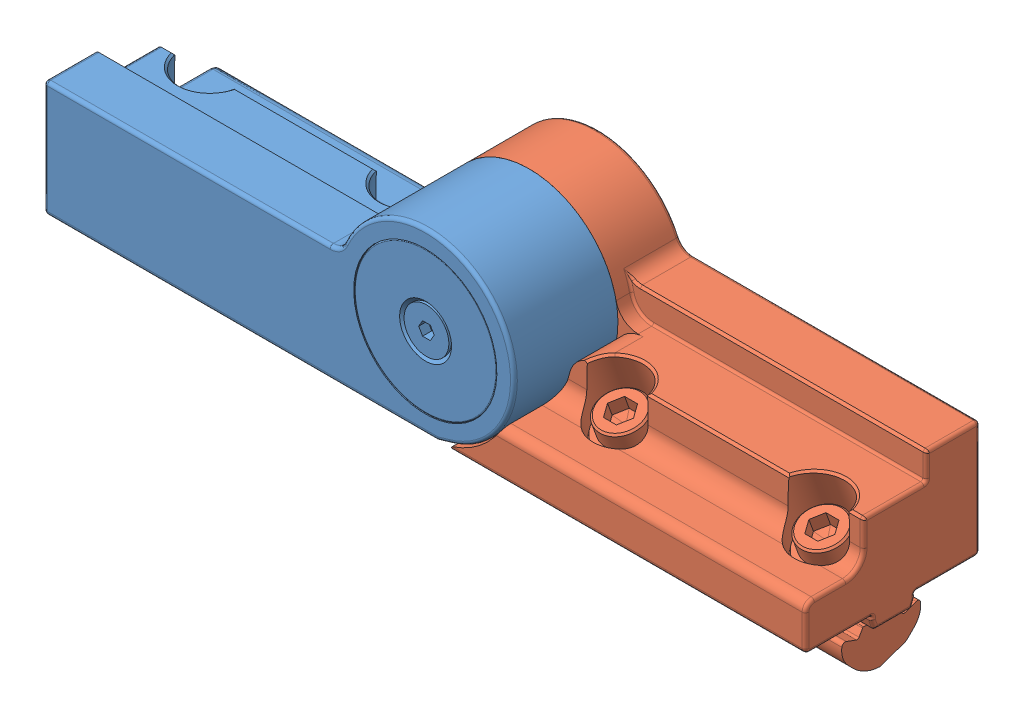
SolidWorks assembly 40mm Pivot Bracket Offset Profile Mount.SLDASM, configuration Standard (file format 13000). Lengths in mm.
Overall size (170.49 52.79 39.25).
2 component instances, 2 part files, 3 mates.
Components (placement in the parent):
- 40mm Pivot Bracket - Offset Profile Mount Female-1: 40mm Pivot Bracket - Offset Profile Mount Female.SLDPRT [Standard] at (0 0 -0.25) size (105.04 52.79 39)
- 40mm Pivot Bracket - Offset Profile Mount Male-1: 40mm Pivot Bracket - Offset Profile Mount Male.SLDPRT [Standard] at origin size (105.04 52.79 39)
Mates (geometry in assembly coordinates):
- Coincident1: coordinate: point of 40mm Pivot Bracket - Offset Profile Mount Male-1
- Concentric1: concentric: cylinder of 40mm Pivot Bracket - Offset Profile Mount Female-1 through (0 20 14.59) axis (0 0 -1) radius 6; cylinder of 40mm Pivot Bracket - Offset Profile Mount Male-1 through (0 20 -22.5246) axis (0 0 -1) radius 6.0063
- Coincident2: coincident anti-aligned: plane of 40mm Pivot Bracket - Offset Profile Mount Female-1 through (-25.3625 14 -4) normal (0 0 -1); plane of 40mm Pivot Bracket - Offset Profile Mount Male-1 through (25.3625 14 -4) normal (0 0 1)
